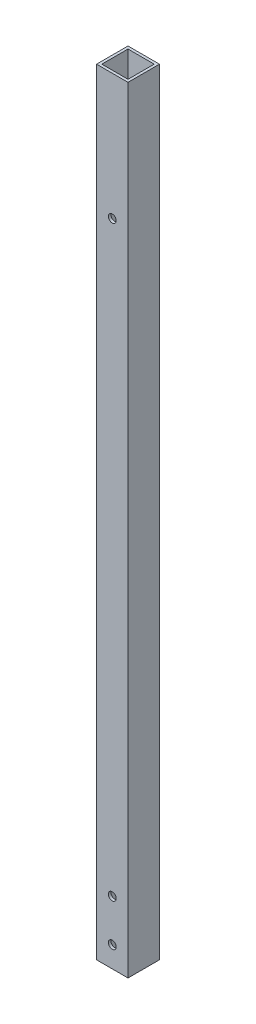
ISO-10303-21;
HEADER;
FILE_DESCRIPTION(('STEP AP214'),'2;1');
FILE_NAME('part.step','',(''),(''),'','','');
FILE_SCHEMA(('AUTOMOTIVE_DESIGN { 1 0 10303 214 1 1 1 1 }'));
ENDSEC;
DATA;
#1=APPLICATION_CONTEXT('core data for automotive mechanical design processes');
#2=APPLICATION_PROTOCOL_DEFINITION('international standard','automotive_design',2000,#1);
#3=PRODUCT_CONTEXT('',#1,'mechanical');
#4=PRODUCT('Part','Part','',(#3));
#5=PRODUCT_RELATED_PRODUCT_CATEGORY('part','',(#4));
#6=PRODUCT_DEFINITION_FORMATION('','',#4);
#7=PRODUCT_DEFINITION_CONTEXT('part definition',#1,'design');
#8=PRODUCT_DEFINITION('design','',#6,#7);
#9=PRODUCT_DEFINITION_SHAPE('','',#8);
#10=(LENGTH_UNIT() NAMED_UNIT(*) SI_UNIT(.MILLI.,.METRE.));
#11=(NAMED_UNIT(*) PLANE_ANGLE_UNIT() SI_UNIT($,.RADIAN.));
#12=(NAMED_UNIT(*) SI_UNIT($,.STERADIAN.) SOLID_ANGLE_UNIT());
#13=UNCERTAINTY_MEASURE_WITH_UNIT(LENGTH_MEASURE(1.E-05),#10,'distance_accuracy_value','');
#14=(GEOMETRIC_REPRESENTATION_CONTEXT(3) GLOBAL_UNCERTAINTY_ASSIGNED_CONTEXT((#13)) GLOBAL_UNIT_ASSIGNED_CONTEXT((#10,
#11,#12)) REPRESENTATION_CONTEXT('',''));
#15=CARTESIAN_POINT('',(0.,0.,0.));
#16=DIRECTION('',(0.,0.,1.));
#17=DIRECTION('',(1.,0.,0.));
#18=AXIS2_PLACEMENT_3D('',#15,#16,#17);
#19=CARTESIAN_POINT('',(0.,939.8,0.));
#20=DIRECTION('',(0.,1.,0.));
#21=DIRECTION('',(0.,0.,1.));
#22=AXIS2_PLACEMENT_3D('',#19,#20,#21);
#23=PLANE('',#22);
#24=DIRECTION('',(0.,0.,1.));
#25=VECTOR('',#24,1.);
#26=CARTESIAN_POINT('',(-19.05,939.8,-19.05));
#27=LINE('',#26,#25);
#28=CARTESIAN_POINT('',(-19.05,939.8,-19.05));
#29=VERTEX_POINT('',#28);
#30=CARTESIAN_POINT('',(-19.05,939.8,19.05));
#31=VERTEX_POINT('',#30);
#32=EDGE_CURVE('E143',#29,#31,#27,.T.);
#33=ORIENTED_EDGE('',*,*,#32,.T.);
#34=DIRECTION('',(1.,0.,0.));
#35=VECTOR('',#34,1.);
#36=CARTESIAN_POINT('',(-19.05,939.8,19.05));
#37=LINE('',#36,#35);
#38=CARTESIAN_POINT('',(19.05,939.8,19.05));
#39=VERTEX_POINT('',#38);
#40=EDGE_CURVE('E146',#31,#39,#37,.T.);
#41=ORIENTED_EDGE('',*,*,#40,.T.);
#42=DIRECTION('',(0.,0.,-1.));
#43=VECTOR('',#42,1.);
#44=CARTESIAN_POINT('',(19.05,939.8,-19.05));
#45=LINE('',#44,#43);
#46=CARTESIAN_POINT('',(19.05,939.8,-19.05));
#47=VERTEX_POINT('',#46);
#48=EDGE_CURVE('E149',#39,#47,#45,.T.);
#49=ORIENTED_EDGE('',*,*,#48,.T.);
#50=DIRECTION('',(-1.,0.,0.));
#51=VECTOR('',#50,1.);
#52=CARTESIAN_POINT('',(-19.05,939.8,-19.05));
#53=LINE('',#52,#51);
#54=EDGE_CURVE('E151',#47,#29,#53,.T.);
#55=ORIENTED_EDGE('',*,*,#54,.T.);
#56=EDGE_LOOP('',(#33,#41,#49,#55));
#57=FACE_BOUND('',#56,.T.);
#58=DIRECTION('',(1.,0.,0.));
#59=VECTOR('',#58,1.);
#60=CARTESIAN_POINT('',(-15.875,939.8,15.875));
#61=LINE('',#60,#59);
#62=CARTESIAN_POINT('',(-15.875,939.8,15.875));
#63=VERTEX_POINT('',#62);
#64=CARTESIAN_POINT('',(15.875,939.8,15.875));
#65=VERTEX_POINT('',#64);
#66=EDGE_CURVE('E113',#63,#65,#61,.T.);
#67=ORIENTED_EDGE('',*,*,#66,.F.);
#68=DIRECTION('',(0.,0.,1.));
#69=VECTOR('',#68,1.);
#70=CARTESIAN_POINT('',(-15.875,939.8,-15.875));
#71=LINE('',#70,#69);
#72=CARTESIAN_POINT('',(-15.875,939.8,-15.875));
#73=VERTEX_POINT('',#72);
#74=EDGE_CURVE('E105',#73,#63,#71,.T.);
#75=ORIENTED_EDGE('',*,*,#74,.F.);
#76=DIRECTION('',(-1.,0.,0.));
#77=VECTOR('',#76,1.);
#78=CARTESIAN_POINT('',(-15.875,939.8,-15.875));
#79=LINE('',#78,#77);
#80=CARTESIAN_POINT('',(15.875,939.8,-15.875));
#81=VERTEX_POINT('',#80);
#82=EDGE_CURVE('E127',#81,#73,#79,.T.);
#83=ORIENTED_EDGE('',*,*,#82,.F.);
#84=DIRECTION('',(0.,0.,-1.));
#85=VECTOR('',#84,1.);
#86=CARTESIAN_POINT('',(15.875,939.8,-15.875));
#87=LINE('',#86,#85);
#88=EDGE_CURVE('E125',#65,#81,#87,.T.);
#89=ORIENTED_EDGE('',*,*,#88,.F.);
#90=EDGE_LOOP('',(#67,#75,#83,#89));
#91=FACE_BOUND('',#90,.T.);
#92=ADVANCED_FACE('F38',(#57,#91),#23,.T.);
#93=CARTESIAN_POINT('',(0.,0.,0.));
#94=DIRECTION('',(0.,1.,0.));
#95=DIRECTION('',(0.,0.,1.));
#96=AXIS2_PLACEMENT_3D('',#93,#94,#95);
#97=PLANE('',#96);
#98=DIRECTION('',(0.,0.,1.));
#99=VECTOR('',#98,1.);
#100=CARTESIAN_POINT('',(-19.05,0.,-19.05));
#101=LINE('',#100,#99);
#102=CARTESIAN_POINT('',(-19.05,0.,-19.05));
#103=VERTEX_POINT('',#102);
#104=CARTESIAN_POINT('',(-19.05,0.,19.05));
#105=VERTEX_POINT('',#104);
#106=EDGE_CURVE('E121',#103,#105,#101,.T.);
#107=ORIENTED_EDGE('',*,*,#106,.F.);
#108=DIRECTION('',(-1.,0.,0.));
#109=VECTOR('',#108,1.);
#110=CARTESIAN_POINT('',(-19.05,0.,-19.05));
#111=LINE('',#110,#109);
#112=CARTESIAN_POINT('',(19.05,0.,-19.05));
#113=VERTEX_POINT('',#112);
#114=EDGE_CURVE('E147',#113,#103,#111,.T.);
#115=ORIENTED_EDGE('',*,*,#114,.F.);
#116=DIRECTION('',(0.,0.,-1.));
#117=VECTOR('',#116,1.);
#118=CARTESIAN_POINT('',(19.05,0.,-19.05));
#119=LINE('',#118,#117);
#120=CARTESIAN_POINT('',(19.05,0.,19.05));
#121=VERTEX_POINT('',#120);
#122=EDGE_CURVE('E158',#121,#113,#119,.T.);
#123=ORIENTED_EDGE('',*,*,#122,.F.);
#124=DIRECTION('',(1.,0.,0.));
#125=VECTOR('',#124,1.);
#126=CARTESIAN_POINT('',(-19.05,0.,19.05));
#127=LINE('',#126,#125);
#128=EDGE_CURVE('E156',#105,#121,#127,.T.);
#129=ORIENTED_EDGE('',*,*,#128,.F.);
#130=EDGE_LOOP('',(#107,#115,#123,#129));
#131=FACE_BOUND('',#130,.T.);
#132=DIRECTION('',(0.,0.,1.));
#133=VECTOR('',#132,1.);
#134=CARTESIAN_POINT('',(-15.875,0.,-15.875));
#135=LINE('',#134,#133);
#136=CARTESIAN_POINT('',(-15.875,0.,-15.875));
#137=VERTEX_POINT('',#136);
#138=CARTESIAN_POINT('',(-15.875,0.,15.875));
#139=VERTEX_POINT('',#138);
#140=EDGE_CURVE('E63',#137,#139,#135,.T.);
#141=ORIENTED_EDGE('',*,*,#140,.T.);
#142=DIRECTION('',(1.,0.,0.));
#143=VECTOR('',#142,1.);
#144=CARTESIAN_POINT('',(-15.875,0.,15.875));
#145=LINE('',#144,#143);
#146=CARTESIAN_POINT('',(15.875,0.,15.875));
#147=VERTEX_POINT('',#146);
#148=EDGE_CURVE('E120',#139,#147,#145,.T.);
#149=ORIENTED_EDGE('',*,*,#148,.T.);
#150=DIRECTION('',(0.,0.,-1.));
#151=VECTOR('',#150,1.);
#152=CARTESIAN_POINT('',(15.875,0.,-15.875));
#153=LINE('',#152,#151);
#154=CARTESIAN_POINT('',(15.875,0.,-15.875));
#155=VERTEX_POINT('',#154);
#156=EDGE_CURVE('E135',#147,#155,#153,.T.);
#157=ORIENTED_EDGE('',*,*,#156,.T.);
#158=DIRECTION('',(-1.,0.,0.));
#159=VECTOR('',#158,1.);
#160=CARTESIAN_POINT('',(-15.875,0.,-15.875));
#161=LINE('',#160,#159);
#162=EDGE_CURVE('E114',#155,#137,#161,.T.);
#163=ORIENTED_EDGE('',*,*,#162,.T.);
#164=EDGE_LOOP('',(#141,#149,#157,#163));
#165=FACE_BOUND('',#164,.T.);
#166=ADVANCED_FACE('F216',(#131,#165),#97,.F.);
#167=CARTESIAN_POINT('',(-19.05,939.8,-19.05));
#168=DIRECTION('',(1.,0.,0.));
#169=DIRECTION('',(0.,0.,-1.));
#170=AXIS2_PLACEMENT_3D('',#167,#168,#169);
#171=PLANE('',#170);
#172=ORIENTED_EDGE('',*,*,#106,.T.);
#173=DIRECTION('',(0.,-1.,0.));
#174=VECTOR('',#173,1.);
#175=CARTESIAN_POINT('',(-19.05,939.8,19.05));
#176=LINE('',#175,#174);
#177=EDGE_CURVE('E11',#31,#105,#176,.T.);
#178=ORIENTED_EDGE('',*,*,#177,.F.);
#179=ORIENTED_EDGE('',*,*,#32,.F.);
#180=DIRECTION('',(0.,-1.,0.));
#181=VECTOR('',#180,1.);
#182=CARTESIAN_POINT('',(-19.05,939.8,-19.05));
#183=LINE('',#182,#181);
#184=EDGE_CURVE('E153',#29,#103,#183,.T.);
#185=ORIENTED_EDGE('',*,*,#184,.T.);
#186=EDGE_LOOP('',(#172,#178,#179,#185));
#187=FACE_BOUND('',#186,.T.);
#188=ADVANCED_FACE('F40',(#187),#171,.F.);
#189=CARTESIAN_POINT('',(-19.05,939.8,19.05));
#190=DIRECTION('',(0.,0.,-1.));
#191=DIRECTION('',(-1.,0.,0.));
#192=AXIS2_PLACEMENT_3D('',#189,#190,#191);
#193=PLANE('',#192);
#194=CARTESIAN_POINT('',(0.,787.4,19.05));
#195=DIRECTION('',(0.,0.,-1.));
#196=DIRECTION('',(-1.,0.,0.));
#197=AXIS2_PLACEMENT_3D('',#194,#195,#196);
#198=CIRCLE('',#197,4.76250000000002);
#199=CARTESIAN_POINT('',(-4.76250000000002,787.4,19.05));
#200=VERTEX_POINT('',#199);
#201=EDGE_CURVE('E240',#200,#200,#198,.T.);
#202=ORIENTED_EDGE('',*,*,#201,.T.);
#203=EDGE_LOOP('',(#202));
#204=FACE_BOUND('',#203,.T.);
#205=CARTESIAN_POINT('',(0.,76.2,19.05));
#206=DIRECTION('',(0.,0.,-1.));
#207=DIRECTION('',(-1.,0.,0.));
#208=AXIS2_PLACEMENT_3D('',#205,#206,#207);
#209=CIRCLE('',#208,4.7625);
#210=CARTESIAN_POINT('',(-4.7625,76.2,19.05));
#211=VERTEX_POINT('',#210);
#212=EDGE_CURVE('E174',#211,#211,#209,.T.);
#213=ORIENTED_EDGE('',*,*,#212,.T.);
#214=EDGE_LOOP('',(#213));
#215=FACE_BOUND('',#214,.T.);
#216=CARTESIAN_POINT('',(0.,25.4,19.05));
#217=DIRECTION('',(0.,0.,-1.));
#218=DIRECTION('',(-1.,0.,0.));
#219=AXIS2_PLACEMENT_3D('',#216,#217,#218);
#220=CIRCLE('',#219,4.7625);
#221=CARTESIAN_POINT('',(-4.7625,25.4,19.05));
#222=VERTEX_POINT('',#221);
#223=EDGE_CURVE('E170',#222,#222,#220,.T.);
#224=ORIENTED_EDGE('',*,*,#223,.T.);
#225=EDGE_LOOP('',(#224));
#226=FACE_BOUND('',#225,.T.);
#227=ORIENTED_EDGE('',*,*,#128,.T.);
#228=DIRECTION('',(0.,-1.,0.));
#229=VECTOR('',#228,1.);
#230=CARTESIAN_POINT('',(19.05,939.8,19.05));
#231=LINE('',#230,#229);
#232=EDGE_CURVE('E47',#39,#121,#231,.T.);
#233=ORIENTED_EDGE('',*,*,#232,.F.);
#234=ORIENTED_EDGE('',*,*,#40,.F.);
#235=ORIENTED_EDGE('',*,*,#177,.T.);
#236=EDGE_LOOP('',(#227,#233,#234,#235));
#237=FACE_BOUND('',#236,.T.);
#238=ADVANCED_FACE('F230',(#204,#215,#226,#237),#193,.F.);
#239=CARTESIAN_POINT('',(19.05,939.8,-19.05));
#240=DIRECTION('',(-1.,0.,0.));
#241=DIRECTION('',(0.,0.,1.));
#242=AXIS2_PLACEMENT_3D('',#239,#240,#241);
#243=PLANE('',#242);
#244=ORIENTED_EDGE('',*,*,#122,.T.);
#245=DIRECTION('',(0.,-1.,0.));
#246=VECTOR('',#245,1.);
#247=CARTESIAN_POINT('',(19.05,939.8,-19.05));
#248=LINE('',#247,#246);
#249=EDGE_CURVE('E163',#47,#113,#248,.T.);
#250=ORIENTED_EDGE('',*,*,#249,.F.);
#251=ORIENTED_EDGE('',*,*,#48,.F.);
#252=ORIENTED_EDGE('',*,*,#232,.T.);
#253=EDGE_LOOP('',(#244,#250,#251,#252));
#254=FACE_BOUND('',#253,.T.);
#255=ADVANCED_FACE('F227',(#254),#243,.F.);
#256=CARTESIAN_POINT('',(-19.05,939.8,-19.05));
#257=DIRECTION('',(0.,0.,1.));
#258=DIRECTION('',(1.,0.,0.));
#259=AXIS2_PLACEMENT_3D('',#256,#257,#258);
#260=PLANE('',#259);
#261=CARTESIAN_POINT('',(0.,787.4,-19.05));
#262=DIRECTION('',(0.,0.,-1.));
#263=DIRECTION('',(-1.,0.,0.));
#264=AXIS2_PLACEMENT_3D('',#261,#262,#263);
#265=CIRCLE('',#264,4.76250000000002);
#266=CARTESIAN_POINT('',(-4.76250000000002,787.4,-19.05));
#267=VERTEX_POINT('',#266);
#268=EDGE_CURVE('E287',#267,#267,#265,.T.);
#269=ORIENTED_EDGE('',*,*,#268,.F.);
#270=EDGE_LOOP('',(#269));
#271=FACE_BOUND('',#270,.T.);
#272=CARTESIAN_POINT('',(0.,76.2,-19.05));
#273=DIRECTION('',(0.,0.,-1.));
#274=DIRECTION('',(-1.,0.,0.));
#275=AXIS2_PLACEMENT_3D('',#272,#273,#274);
#276=CIRCLE('',#275,4.7625);
#277=CARTESIAN_POINT('',(-4.7625,76.2,-19.05));
#278=VERTEX_POINT('',#277);
#279=EDGE_CURVE('E181',#278,#278,#276,.T.);
#280=ORIENTED_EDGE('',*,*,#279,.F.);
#281=EDGE_LOOP('',(#280));
#282=FACE_BOUND('',#281,.T.);
#283=CARTESIAN_POINT('',(0.,25.4,-19.05));
#284=DIRECTION('',(0.,0.,-1.));
#285=DIRECTION('',(-1.,0.,0.));
#286=AXIS2_PLACEMENT_3D('',#283,#284,#285);
#287=CIRCLE('',#286,4.7625);
#288=CARTESIAN_POINT('',(-4.7625,25.4,-19.05));
#289=VERTEX_POINT('',#288);
#290=EDGE_CURVE('E178',#289,#289,#287,.T.);
#291=ORIENTED_EDGE('',*,*,#290,.F.);
#292=EDGE_LOOP('',(#291));
#293=FACE_BOUND('',#292,.T.);
#294=ORIENTED_EDGE('',*,*,#114,.T.);
#295=ORIENTED_EDGE('',*,*,#184,.F.);
#296=ORIENTED_EDGE('',*,*,#54,.F.);
#297=ORIENTED_EDGE('',*,*,#249,.T.);
#298=EDGE_LOOP('',(#294,#295,#296,#297));
#299=FACE_BOUND('',#298,.T.);
#300=ADVANCED_FACE('F211',(#271,#282,#293,#299),#260,.F.);
#301=CARTESIAN_POINT('',(-15.875,939.8,-15.875));
#302=DIRECTION('',(1.,0.,0.));
#303=DIRECTION('',(0.,0.,-1.));
#304=AXIS2_PLACEMENT_3D('',#301,#302,#303);
#305=PLANE('',#304);
#306=ORIENTED_EDGE('',*,*,#140,.F.);
#307=DIRECTION('',(0.,-1.,0.));
#308=VECTOR('',#307,1.);
#309=CARTESIAN_POINT('',(-15.875,939.8,-15.875));
#310=LINE('',#309,#308);
#311=EDGE_CURVE('E109',#73,#137,#310,.T.);
#312=ORIENTED_EDGE('',*,*,#311,.F.);
#313=ORIENTED_EDGE('',*,*,#74,.T.);
#314=DIRECTION('',(0.,-1.,0.));
#315=VECTOR('',#314,1.);
#316=CARTESIAN_POINT('',(-15.875,939.8,15.875));
#317=LINE('',#316,#315);
#318=EDGE_CURVE('E108',#63,#139,#317,.T.);
#319=ORIENTED_EDGE('',*,*,#318,.T.);
#320=EDGE_LOOP('',(#306,#312,#313,#319));
#321=FACE_BOUND('',#320,.T.);
#322=ADVANCED_FACE('F107',(#321),#305,.T.);
#323=CARTESIAN_POINT('',(-15.875,939.8,15.875));
#324=DIRECTION('',(0.,0.,-1.));
#325=DIRECTION('',(-1.,0.,0.));
#326=AXIS2_PLACEMENT_3D('',#323,#324,#325);
#327=PLANE('',#326);
#328=CARTESIAN_POINT('',(0.,787.4,15.875));
#329=DIRECTION('',(0.,0.,-1.));
#330=DIRECTION('',(-1.,0.,0.));
#331=AXIS2_PLACEMENT_3D('',#328,#329,#330);
#332=CIRCLE('',#331,4.76250000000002);
#333=CARTESIAN_POINT('',(-4.76250000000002,787.4,15.875));
#334=VERTEX_POINT('',#333);
#335=EDGE_CURVE('E186',#334,#334,#332,.T.);
#336=ORIENTED_EDGE('',*,*,#335,.F.);
#337=EDGE_LOOP('',(#336));
#338=FACE_BOUND('',#337,.T.);
#339=CARTESIAN_POINT('',(0.,76.2,15.875));
#340=DIRECTION('',(0.,0.,-1.));
#341=DIRECTION('',(-1.,0.,0.));
#342=AXIS2_PLACEMENT_3D('',#339,#340,#341);
#343=CIRCLE('',#342,4.7625);
#344=CARTESIAN_POINT('',(-4.7625,76.2,15.875));
#345=VERTEX_POINT('',#344);
#346=EDGE_CURVE('E173',#345,#345,#343,.T.);
#347=ORIENTED_EDGE('',*,*,#346,.F.);
#348=EDGE_LOOP('',(#347));
#349=FACE_BOUND('',#348,.T.);
#350=CARTESIAN_POINT('',(0.,25.4,15.875));
#351=DIRECTION('',(0.,0.,-1.));
#352=DIRECTION('',(-1.,0.,0.));
#353=AXIS2_PLACEMENT_3D('',#350,#351,#352);
#354=CIRCLE('',#353,4.7625);
#355=CARTESIAN_POINT('',(-4.7625,25.4,15.875));
#356=VERTEX_POINT('',#355);
#357=EDGE_CURVE('E133',#356,#356,#354,.T.);
#358=ORIENTED_EDGE('',*,*,#357,.F.);
#359=EDGE_LOOP('',(#358));
#360=FACE_BOUND('',#359,.T.);
#361=ORIENTED_EDGE('',*,*,#148,.F.);
#362=ORIENTED_EDGE('',*,*,#318,.F.);
#363=ORIENTED_EDGE('',*,*,#66,.T.);
#364=DIRECTION('',(0.,-1.,0.));
#365=VECTOR('',#364,1.);
#366=CARTESIAN_POINT('',(15.875,939.8,15.875));
#367=LINE('',#366,#365);
#368=EDGE_CURVE('E122',#65,#147,#367,.T.);
#369=ORIENTED_EDGE('',*,*,#368,.T.);
#370=EDGE_LOOP('',(#361,#362,#363,#369));
#371=FACE_BOUND('',#370,.T.);
#372=ADVANCED_FACE('F117',(#338,#349,#360,#371),#327,.T.);
#373=CARTESIAN_POINT('',(15.875,939.8,-15.875));
#374=DIRECTION('',(-1.,0.,0.));
#375=DIRECTION('',(0.,0.,1.));
#376=AXIS2_PLACEMENT_3D('',#373,#374,#375);
#377=PLANE('',#376);
#378=ORIENTED_EDGE('',*,*,#156,.F.);
#379=ORIENTED_EDGE('',*,*,#368,.F.);
#380=ORIENTED_EDGE('',*,*,#88,.T.);
#381=DIRECTION('',(0.,-1.,0.));
#382=VECTOR('',#381,1.);
#383=CARTESIAN_POINT('',(15.875,939.8,-15.875));
#384=LINE('',#383,#382);
#385=EDGE_CURVE('E55',#81,#155,#384,.T.);
#386=ORIENTED_EDGE('',*,*,#385,.T.);
#387=EDGE_LOOP('',(#378,#379,#380,#386));
#388=FACE_BOUND('',#387,.T.);
#389=ADVANCED_FACE('F201',(#388),#377,.T.);
#390=CARTESIAN_POINT('',(-15.875,939.8,-15.875));
#391=DIRECTION('',(0.,0.,1.));
#392=DIRECTION('',(1.,0.,0.));
#393=AXIS2_PLACEMENT_3D('',#390,#391,#392);
#394=PLANE('',#393);
#395=CARTESIAN_POINT('',(0.,787.4,-15.875));
#396=DIRECTION('',(0.,0.,1.));
#397=DIRECTION('',(1.,0.,0.));
#398=AXIS2_PLACEMENT_3D('',#395,#396,#397);
#399=CIRCLE('',#398,4.76250000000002);
#400=CARTESIAN_POINT('',(-4.76250000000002,787.4,-15.875));
#401=VERTEX_POINT('',#400);
#402=EDGE_CURVE('E42',#401,#401,#399,.T.);
#403=ORIENTED_EDGE('',*,*,#402,.F.);
#404=EDGE_LOOP('',(#403));
#405=FACE_BOUND('',#404,.T.);
#406=CARTESIAN_POINT('',(0.,76.2,-15.875));
#407=DIRECTION('',(0.,0.,1.));
#408=DIRECTION('',(1.,0.,0.));
#409=AXIS2_PLACEMENT_3D('',#406,#407,#408);
#410=CIRCLE('',#409,4.7625);
#411=CARTESIAN_POINT('',(-4.7625,76.2,-15.875));
#412=VERTEX_POINT('',#411);
#413=EDGE_CURVE('E171',#412,#412,#410,.T.);
#414=ORIENTED_EDGE('',*,*,#413,.F.);
#415=EDGE_LOOP('',(#414));
#416=FACE_BOUND('',#415,.T.);
#417=CARTESIAN_POINT('',(0.,25.4,-15.875));
#418=DIRECTION('',(0.,0.,1.));
#419=DIRECTION('',(1.,0.,0.));
#420=AXIS2_PLACEMENT_3D('',#417,#418,#419);
#421=CIRCLE('',#420,4.7625);
#422=CARTESIAN_POINT('',(-4.7625,25.4,-15.875));
#423=VERTEX_POINT('',#422);
#424=EDGE_CURVE('E168',#423,#423,#421,.T.);
#425=ORIENTED_EDGE('',*,*,#424,.F.);
#426=EDGE_LOOP('',(#425));
#427=FACE_BOUND('',#426,.T.);
#428=ORIENTED_EDGE('',*,*,#162,.F.);
#429=ORIENTED_EDGE('',*,*,#385,.F.);
#430=ORIENTED_EDGE('',*,*,#82,.T.);
#431=ORIENTED_EDGE('',*,*,#311,.T.);
#432=EDGE_LOOP('',(#428,#429,#430,#431));
#433=FACE_BOUND('',#432,.T.);
#434=ADVANCED_FACE('F208',(#405,#416,#427,#433),#394,.T.);
#435=CARTESIAN_POINT('',(0.,25.4,19.05));
#436=DIRECTION('',(0.,0.,-1.));
#437=DIRECTION('',(-1.,0.,0.));
#438=AXIS2_PLACEMENT_3D('',#435,#436,#437);
#439=CYLINDRICAL_SURFACE('',#438,4.7625);
#440=CARTESIAN_POINT('',(-4.7625,25.4,-15.875));
#441=CARTESIAN_POINT('',(-4.7625,25.4,-15.9080729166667));
#442=CARTESIAN_POINT('',(-4.7625,25.4,-15.9411458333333));
#443=CARTESIAN_POINT('',(-4.7625,25.4,-16.0072916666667));
#444=CARTESIAN_POINT('',(-4.7625,25.4,-16.0403645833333));
#445=CARTESIAN_POINT('',(-4.7625,25.4,-16.1065104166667));
#446=CARTESIAN_POINT('',(-4.7625,25.4,-16.1395833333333));
#447=CARTESIAN_POINT('',(-4.7625,25.4,-16.2057291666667));
#448=CARTESIAN_POINT('',(-4.7625,25.4,-16.2388020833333));
#449=CARTESIAN_POINT('',(-4.7625,25.4,-16.3049479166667));
#450=CARTESIAN_POINT('',(-4.7625,25.4,-16.3380208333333));
#451=CARTESIAN_POINT('',(-4.7625,25.4,-16.4041666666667));
#452=CARTESIAN_POINT('',(-4.7625,25.4,-16.4372395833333));
#453=CARTESIAN_POINT('',(-4.7625,25.4,-16.5033854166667));
#454=CARTESIAN_POINT('',(-4.7625,25.4,-16.5364583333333));
#455=CARTESIAN_POINT('',(-4.7625,25.4,-16.6026041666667));
#456=CARTESIAN_POINT('',(-4.7625,25.4,-16.6356770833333));
#457=CARTESIAN_POINT('',(-4.7625,25.4,-16.7018229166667));
#458=CARTESIAN_POINT('',(-4.7625,25.4,-16.7348958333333));
#459=CARTESIAN_POINT('',(-4.7625,25.4,-16.8010416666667));
#460=CARTESIAN_POINT('',(-4.7625,25.4,-16.8341145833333));
#461=CARTESIAN_POINT('',(-4.7625,25.4,-16.9002604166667));
#462=CARTESIAN_POINT('',(-4.7625,25.4,-16.9333333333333));
#463=CARTESIAN_POINT('',(-4.7625,25.4,-16.9994791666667));
#464=CARTESIAN_POINT('',(-4.7625,25.4,-17.0325520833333));
#465=CARTESIAN_POINT('',(-4.7625,25.4,-17.0986979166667));
#466=CARTESIAN_POINT('',(-4.7625,25.4,-17.1317708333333));
#467=CARTESIAN_POINT('',(-4.7625,25.4,-17.1979166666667));
#468=CARTESIAN_POINT('',(-4.7625,25.4,-17.2309895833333));
#469=CARTESIAN_POINT('',(-4.7625,25.4,-17.2971354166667));
#470=CARTESIAN_POINT('',(-4.7625,25.4,-17.3302083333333));
#471=CARTESIAN_POINT('',(-4.7625,25.4,-17.3963541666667));
#472=CARTESIAN_POINT('',(-4.7625,25.4,-17.4294270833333));
#473=CARTESIAN_POINT('',(-4.7625,25.4,-17.4955729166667));
#474=CARTESIAN_POINT('',(-4.7625,25.4,-17.5286458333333));
#475=CARTESIAN_POINT('',(-4.7625,25.4,-17.5947916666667));
#476=CARTESIAN_POINT('',(-4.7625,25.4,-17.6278645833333));
#477=CARTESIAN_POINT('',(-4.7625,25.4,-17.6940104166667));
#478=CARTESIAN_POINT('',(-4.7625,25.4,-17.7270833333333));
#479=CARTESIAN_POINT('',(-4.7625,25.4,-17.7932291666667));
#480=CARTESIAN_POINT('',(-4.7625,25.4,-17.8263020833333));
#481=CARTESIAN_POINT('',(-4.7625,25.4,-17.8924479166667));
#482=CARTESIAN_POINT('',(-4.7625,25.4,-17.9255208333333));
#483=CARTESIAN_POINT('',(-4.7625,25.4,-17.9916666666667));
#484=CARTESIAN_POINT('',(-4.7625,25.4,-18.0247395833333));
#485=CARTESIAN_POINT('',(-4.7625,25.4,-18.0908854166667));
#486=CARTESIAN_POINT('',(-4.7625,25.4,-18.1239583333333));
#487=CARTESIAN_POINT('',(-4.7625,25.4,-18.1901041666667));
#488=CARTESIAN_POINT('',(-4.7625,25.4,-18.2231770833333));
#489=CARTESIAN_POINT('',(-4.7625,25.4,-18.2893229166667));
#490=CARTESIAN_POINT('',(-4.7625,25.4,-18.3223958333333));
#491=CARTESIAN_POINT('',(-4.7625,25.4,-18.3885416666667));
#492=CARTESIAN_POINT('',(-4.7625,25.4,-18.4216145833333));
#493=CARTESIAN_POINT('',(-4.7625,25.4,-18.4877604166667));
#494=CARTESIAN_POINT('',(-4.7625,25.4,-18.5208333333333));
#495=CARTESIAN_POINT('',(-4.7625,25.4,-18.5869791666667));
#496=CARTESIAN_POINT('',(-4.7625,25.4,-18.6200520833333));
#497=CARTESIAN_POINT('',(-4.7625,25.4,-18.6861979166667));
#498=CARTESIAN_POINT('',(-4.7625,25.4,-18.7192708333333));
#499=CARTESIAN_POINT('',(-4.7625,25.4,-18.7854166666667));
#500=CARTESIAN_POINT('',(-4.7625,25.4,-18.8184895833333));
#501=CARTESIAN_POINT('',(-4.7625,25.4,-18.8846354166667));
#502=CARTESIAN_POINT('',(-4.7625,25.4,-18.9177083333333));
#503=CARTESIAN_POINT('',(-4.7625,25.4,-18.9838541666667));
#504=CARTESIAN_POINT('',(-4.7625,25.4,-19.0169270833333));
#505=CARTESIAN_POINT('',(-4.7625,25.4,-19.05));
#506=B_SPLINE_CURVE_WITH_KNOTS('',3,(#440,#441,#442,#443,#444,#445,#446,#447,#448,#449,#450,
#451,#452,#453,#454,#455,#456,#457,#458,#459,#460,#461,#462,#463,#464,#465,#466,#467,#468,#469,
#470,#471,#472,#473,#474,#475,#476,#477,#478,#479,#480,#481,#482,#483,#484,#485,#486,#487,#488,
#489,#490,#491,#492,#493,#494,#495,#496,#497,#498,#499,#500,#501,#502,#503,#504,#505),
.UNSPECIFIED.,.F.,.F.,(4,2,2,2,2,2,2,2,2,2,2,2,2,2,2,2,2,2,2,2,2,2,2,2,2,2,2,2,2,2,2,2,4),(0.,
0.0992187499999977,0.198437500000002,0.29765625,0.396874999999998,0.496093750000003,0.5953125,
0.694531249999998,0.793749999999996,0.892968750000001,0.992187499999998,1.09140625,1.190625,
1.28984375,1.3890625,1.48828125,1.5875,1.68671875,1.7859375,1.88515625,1.984375,2.08359375,
2.1828125,2.28203125,2.38125,2.48046875,2.5796875,2.67890624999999,2.778125,2.87734375,
2.97656249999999,3.07578125,3.175),.UNSPECIFIED.);
#507=EDGE_CURVE('BSEAM258',#423,#289,#506,.T.);
#508=ORIENTED_EDGE('',*,*,#424,.T.);
#509=ORIENTED_EDGE('',*,*,#290,.T.);
#510=ORIENTED_EDGE('',*,*,#507,.T.);
#511=ORIENTED_EDGE('',*,*,#507,.F.);
#512=EDGE_LOOP('',(#508,#510,#509,#511));
#513=FACE_BOUND('',#512,.T.);
#514=ADVANCED_FACE('F258',(#513),#439,.F.);
#515=CARTESIAN_POINT('',(-4.7625,25.4,15.875));
#516=CARTESIAN_POINT('',(-4.7625,25.4,15.9080729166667));
#517=CARTESIAN_POINT('',(-4.7625,25.4,15.9411458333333));
#518=CARTESIAN_POINT('',(-4.7625,25.4,16.0072916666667));
#519=CARTESIAN_POINT('',(-4.7625,25.4,16.0403645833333));
#520=CARTESIAN_POINT('',(-4.7625,25.4,16.1065104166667));
#521=CARTESIAN_POINT('',(-4.7625,25.4,16.1395833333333));
#522=CARTESIAN_POINT('',(-4.7625,25.4,16.2057291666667));
#523=CARTESIAN_POINT('',(-4.7625,25.4,16.2388020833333));
#524=CARTESIAN_POINT('',(-4.7625,25.4,16.3049479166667));
#525=CARTESIAN_POINT('',(-4.7625,25.4,16.3380208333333));
#526=CARTESIAN_POINT('',(-4.7625,25.4,16.4041666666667));
#527=CARTESIAN_POINT('',(-4.7625,25.4,16.4372395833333));
#528=CARTESIAN_POINT('',(-4.7625,25.4,16.5033854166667));
#529=CARTESIAN_POINT('',(-4.7625,25.4,16.5364583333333));
#530=CARTESIAN_POINT('',(-4.7625,25.4,16.6026041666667));
#531=CARTESIAN_POINT('',(-4.7625,25.4,16.6356770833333));
#532=CARTESIAN_POINT('',(-4.7625,25.4,16.7018229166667));
#533=CARTESIAN_POINT('',(-4.7625,25.4,16.7348958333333));
#534=CARTESIAN_POINT('',(-4.7625,25.4,16.8010416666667));
#535=CARTESIAN_POINT('',(-4.7625,25.4,16.8341145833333));
#536=CARTESIAN_POINT('',(-4.7625,25.4,16.9002604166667));
#537=CARTESIAN_POINT('',(-4.7625,25.4,16.9333333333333));
#538=CARTESIAN_POINT('',(-4.7625,25.4,16.9994791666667));
#539=CARTESIAN_POINT('',(-4.7625,25.4,17.0325520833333));
#540=CARTESIAN_POINT('',(-4.7625,25.4,17.0986979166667));
#541=CARTESIAN_POINT('',(-4.7625,25.4,17.1317708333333));
#542=CARTESIAN_POINT('',(-4.7625,25.4,17.1979166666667));
#543=CARTESIAN_POINT('',(-4.7625,25.4,17.2309895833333));
#544=CARTESIAN_POINT('',(-4.7625,25.4,17.2971354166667));
#545=CARTESIAN_POINT('',(-4.7625,25.4,17.3302083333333));
#546=CARTESIAN_POINT('',(-4.7625,25.4,17.3963541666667));
#547=CARTESIAN_POINT('',(-4.7625,25.4,17.4294270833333));
#548=CARTESIAN_POINT('',(-4.7625,25.4,17.4955729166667));
#549=CARTESIAN_POINT('',(-4.7625,25.4,17.5286458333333));
#550=CARTESIAN_POINT('',(-4.7625,25.4,17.5947916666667));
#551=CARTESIAN_POINT('',(-4.7625,25.4,17.6278645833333));
#552=CARTESIAN_POINT('',(-4.7625,25.4,17.6940104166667));
#553=CARTESIAN_POINT('',(-4.7625,25.4,17.7270833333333));
#554=CARTESIAN_POINT('',(-4.7625,25.4,17.7932291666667));
#555=CARTESIAN_POINT('',(-4.7625,25.4,17.8263020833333));
#556=CARTESIAN_POINT('',(-4.7625,25.4,17.8924479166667));
#557=CARTESIAN_POINT('',(-4.7625,25.4,17.9255208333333));
#558=CARTESIAN_POINT('',(-4.7625,25.4,17.9916666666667));
#559=CARTESIAN_POINT('',(-4.7625,25.4,18.0247395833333));
#560=CARTESIAN_POINT('',(-4.7625,25.4,18.0908854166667));
#561=CARTESIAN_POINT('',(-4.7625,25.4,18.1239583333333));
#562=CARTESIAN_POINT('',(-4.7625,25.4,18.1901041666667));
#563=CARTESIAN_POINT('',(-4.7625,25.4,18.2231770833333));
#564=CARTESIAN_POINT('',(-4.7625,25.4,18.2893229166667));
#565=CARTESIAN_POINT('',(-4.7625,25.4,18.3223958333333));
#566=CARTESIAN_POINT('',(-4.7625,25.4,18.3885416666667));
#567=CARTESIAN_POINT('',(-4.7625,25.4,18.4216145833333));
#568=CARTESIAN_POINT('',(-4.7625,25.4,18.4877604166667));
#569=CARTESIAN_POINT('',(-4.7625,25.4,18.5208333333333));
#570=CARTESIAN_POINT('',(-4.7625,25.4,18.5869791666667));
#571=CARTESIAN_POINT('',(-4.7625,25.4,18.6200520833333));
#572=CARTESIAN_POINT('',(-4.7625,25.4,18.6861979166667));
#573=CARTESIAN_POINT('',(-4.7625,25.4,18.7192708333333));
#574=CARTESIAN_POINT('',(-4.7625,25.4,18.7854166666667));
#575=CARTESIAN_POINT('',(-4.7625,25.4,18.8184895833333));
#576=CARTESIAN_POINT('',(-4.7625,25.4,18.8846354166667));
#577=CARTESIAN_POINT('',(-4.7625,25.4,18.9177083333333));
#578=CARTESIAN_POINT('',(-4.7625,25.4,18.9838541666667));
#579=CARTESIAN_POINT('',(-4.7625,25.4,19.0169270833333));
#580=CARTESIAN_POINT('',(-4.7625,25.4,19.05));
#581=B_SPLINE_CURVE_WITH_KNOTS('',3,(#515,#516,#517,#518,#519,#520,#521,#522,#523,#524,#525,
#526,#527,#528,#529,#530,#531,#532,#533,#534,#535,#536,#537,#538,#539,#540,#541,#542,#543,#544,
#545,#546,#547,#548,#549,#550,#551,#552,#553,#554,#555,#556,#557,#558,#559,#560,#561,#562,#563,
#564,#565,#566,#567,#568,#569,#570,#571,#572,#573,#574,#575,#576,#577,#578,#579,#580),
.UNSPECIFIED.,.F.,.F.,(4,2,2,2,2,2,2,2,2,2,2,2,2,2,2,2,2,2,2,2,2,2,2,2,2,2,2,2,2,2,2,2,4),(0.,
0.0992187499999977,0.198437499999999,0.29765625,0.396874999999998,0.496093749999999,0.5953125,
0.694531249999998,0.793749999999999,0.892968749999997,0.992187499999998,1.09140625,1.190625,
1.28984375,1.3890625,1.48828125,1.5875,1.68671875,1.7859375,1.88515625,1.984375,2.08359375,
2.1828125,2.28203125,2.38125,2.48046875,2.5796875,2.67890625,2.778125,2.87734375,2.9765625,
3.07578125,3.175),.UNSPECIFIED.);
#582=EDGE_CURVE('BSEAM197',#356,#222,#581,.T.);
#583=ORIENTED_EDGE('',*,*,#357,.T.);
#584=ORIENTED_EDGE('',*,*,#223,.F.);
#585=ORIENTED_EDGE('',*,*,#582,.T.);
#586=ORIENTED_EDGE('',*,*,#582,.F.);
#587=EDGE_LOOP('',(#583,#585,#584,#586));
#588=FACE_BOUND('',#587,.T.);
#589=ADVANCED_FACE('F197',(#588),#439,.F.);
#590=CARTESIAN_POINT('',(0.,76.2,19.05));
#591=DIRECTION('',(0.,0.,-1.));
#592=DIRECTION('',(-1.,0.,0.));
#593=AXIS2_PLACEMENT_3D('',#590,#591,#592);
#594=CYLINDRICAL_SURFACE('',#593,4.7625);
#595=CARTESIAN_POINT('',(-4.7625,76.2,-15.875));
#596=CARTESIAN_POINT('',(-4.7625,76.2,-15.9080729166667));
#597=CARTESIAN_POINT('',(-4.7625,76.2,-15.9411458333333));
#598=CARTESIAN_POINT('',(-4.7625,76.2,-16.0072916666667));
#599=CARTESIAN_POINT('',(-4.7625,76.2,-16.0403645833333));
#600=CARTESIAN_POINT('',(-4.7625,76.2,-16.1065104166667));
#601=CARTESIAN_POINT('',(-4.7625,76.2,-16.1395833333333));
#602=CARTESIAN_POINT('',(-4.7625,76.2,-16.2057291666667));
#603=CARTESIAN_POINT('',(-4.7625,76.2,-16.2388020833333));
#604=CARTESIAN_POINT('',(-4.7625,76.2,-16.3049479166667));
#605=CARTESIAN_POINT('',(-4.7625,76.2,-16.3380208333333));
#606=CARTESIAN_POINT('',(-4.7625,76.2,-16.4041666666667));
#607=CARTESIAN_POINT('',(-4.7625,76.2,-16.4372395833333));
#608=CARTESIAN_POINT('',(-4.7625,76.2,-16.5033854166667));
#609=CARTESIAN_POINT('',(-4.7625,76.2,-16.5364583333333));
#610=CARTESIAN_POINT('',(-4.7625,76.2,-16.6026041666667));
#611=CARTESIAN_POINT('',(-4.7625,76.2,-16.6356770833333));
#612=CARTESIAN_POINT('',(-4.7625,76.2,-16.7018229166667));
#613=CARTESIAN_POINT('',(-4.7625,76.2,-16.7348958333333));
#614=CARTESIAN_POINT('',(-4.7625,76.2,-16.8010416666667));
#615=CARTESIAN_POINT('',(-4.7625,76.2,-16.8341145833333));
#616=CARTESIAN_POINT('',(-4.7625,76.2,-16.9002604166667));
#617=CARTESIAN_POINT('',(-4.7625,76.2,-16.9333333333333));
#618=CARTESIAN_POINT('',(-4.7625,76.2,-16.9994791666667));
#619=CARTESIAN_POINT('',(-4.7625,76.2,-17.0325520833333));
#620=CARTESIAN_POINT('',(-4.7625,76.2,-17.0986979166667));
#621=CARTESIAN_POINT('',(-4.7625,76.2,-17.1317708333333));
#622=CARTESIAN_POINT('',(-4.7625,76.2,-17.1979166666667));
#623=CARTESIAN_POINT('',(-4.7625,76.2,-17.2309895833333));
#624=CARTESIAN_POINT('',(-4.7625,76.2,-17.2971354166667));
#625=CARTESIAN_POINT('',(-4.7625,76.2,-17.3302083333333));
#626=CARTESIAN_POINT('',(-4.7625,76.2,-17.3963541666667));
#627=CARTESIAN_POINT('',(-4.7625,76.2,-17.4294270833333));
#628=CARTESIAN_POINT('',(-4.7625,76.2,-17.4955729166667));
#629=CARTESIAN_POINT('',(-4.7625,76.2,-17.5286458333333));
#630=CARTESIAN_POINT('',(-4.7625,76.2,-17.5947916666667));
#631=CARTESIAN_POINT('',(-4.7625,76.2,-17.6278645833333));
#632=CARTESIAN_POINT('',(-4.7625,76.2,-17.6940104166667));
#633=CARTESIAN_POINT('',(-4.7625,76.2,-17.7270833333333));
#634=CARTESIAN_POINT('',(-4.7625,76.2,-17.7932291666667));
#635=CARTESIAN_POINT('',(-4.7625,76.2,-17.8263020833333));
#636=CARTESIAN_POINT('',(-4.7625,76.2,-17.8924479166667));
#637=CARTESIAN_POINT('',(-4.7625,76.2,-17.9255208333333));
#638=CARTESIAN_POINT('',(-4.7625,76.2,-17.9916666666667));
#639=CARTESIAN_POINT('',(-4.7625,76.2,-18.0247395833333));
#640=CARTESIAN_POINT('',(-4.7625,76.2,-18.0908854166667));
#641=CARTESIAN_POINT('',(-4.7625,76.2,-18.1239583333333));
#642=CARTESIAN_POINT('',(-4.7625,76.2,-18.1901041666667));
#643=CARTESIAN_POINT('',(-4.7625,76.2,-18.2231770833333));
#644=CARTESIAN_POINT('',(-4.7625,76.2,-18.2893229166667));
#645=CARTESIAN_POINT('',(-4.7625,76.2,-18.3223958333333));
#646=CARTESIAN_POINT('',(-4.7625,76.2,-18.3885416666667));
#647=CARTESIAN_POINT('',(-4.7625,76.2,-18.4216145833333));
#648=CARTESIAN_POINT('',(-4.7625,76.2,-18.4877604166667));
#649=CARTESIAN_POINT('',(-4.7625,76.2,-18.5208333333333));
#650=CARTESIAN_POINT('',(-4.7625,76.2,-18.5869791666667));
#651=CARTESIAN_POINT('',(-4.7625,76.2,-18.6200520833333));
#652=CARTESIAN_POINT('',(-4.7625,76.2,-18.6861979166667));
#653=CARTESIAN_POINT('',(-4.7625,76.2,-18.7192708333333));
#654=CARTESIAN_POINT('',(-4.7625,76.2,-18.7854166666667));
#655=CARTESIAN_POINT('',(-4.7625,76.2,-18.8184895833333));
#656=CARTESIAN_POINT('',(-4.7625,76.2,-18.8846354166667));
#657=CARTESIAN_POINT('',(-4.7625,76.2,-18.9177083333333));
#658=CARTESIAN_POINT('',(-4.7625,76.2,-18.9838541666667));
#659=CARTESIAN_POINT('',(-4.7625,76.2,-19.0169270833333));
#660=CARTESIAN_POINT('',(-4.7625,76.2,-19.05));
#661=B_SPLINE_CURVE_WITH_KNOTS('',3,(#595,#596,#597,#598,#599,#600,#601,#602,#603,#604,#605,
#606,#607,#608,#609,#610,#611,#612,#613,#614,#615,#616,#617,#618,#619,#620,#621,#622,#623,#624,
#625,#626,#627,#628,#629,#630,#631,#632,#633,#634,#635,#636,#637,#638,#639,#640,#641,#642,#643,
#644,#645,#646,#647,#648,#649,#650,#651,#652,#653,#654,#655,#656,#657,#658,#659,#660),
.UNSPECIFIED.,.F.,.F.,(4,2,2,2,2,2,2,2,2,2,2,2,2,2,2,2,2,2,2,2,2,2,2,2,2,2,2,2,2,2,2,2,4),(0.,
0.0992187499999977,0.198437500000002,0.29765625,0.396874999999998,0.496093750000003,0.5953125,
0.694531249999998,0.793749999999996,0.892968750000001,0.992187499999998,1.09140625,1.190625,
1.28984375,1.3890625,1.48828125,1.5875,1.68671875,1.7859375,1.88515625,1.984375,2.08359375,
2.1828125,2.28203125,2.38125,2.48046875,2.5796875,2.67890624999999,2.778125,2.87734375,
2.97656249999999,3.07578125,3.175),.UNSPECIFIED.);
#662=EDGE_CURVE('BSEAM269',#412,#278,#661,.T.);
#663=ORIENTED_EDGE('',*,*,#413,.T.);
#664=ORIENTED_EDGE('',*,*,#279,.T.);
#665=ORIENTED_EDGE('',*,*,#662,.T.);
#666=ORIENTED_EDGE('',*,*,#662,.F.);
#667=EDGE_LOOP('',(#663,#665,#664,#666));
#668=FACE_BOUND('',#667,.T.);
#669=ADVANCED_FACE('F269',(#668),#594,.F.);
#670=CARTESIAN_POINT('',(-4.7625,76.2,15.875));
#671=CARTESIAN_POINT('',(-4.7625,76.2,15.9080729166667));
#672=CARTESIAN_POINT('',(-4.7625,76.2,15.9411458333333));
#673=CARTESIAN_POINT('',(-4.7625,76.2,16.0072916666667));
#674=CARTESIAN_POINT('',(-4.7625,76.2,16.0403645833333));
#675=CARTESIAN_POINT('',(-4.7625,76.2,16.1065104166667));
#676=CARTESIAN_POINT('',(-4.7625,76.2,16.1395833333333));
#677=CARTESIAN_POINT('',(-4.7625,76.2,16.2057291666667));
#678=CARTESIAN_POINT('',(-4.7625,76.2,16.2388020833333));
#679=CARTESIAN_POINT('',(-4.7625,76.2,16.3049479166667));
#680=CARTESIAN_POINT('',(-4.7625,76.2,16.3380208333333));
#681=CARTESIAN_POINT('',(-4.7625,76.2,16.4041666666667));
#682=CARTESIAN_POINT('',(-4.7625,76.2,16.4372395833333));
#683=CARTESIAN_POINT('',(-4.7625,76.2,16.5033854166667));
#684=CARTESIAN_POINT('',(-4.7625,76.2,16.5364583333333));
#685=CARTESIAN_POINT('',(-4.7625,76.2,16.6026041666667));
#686=CARTESIAN_POINT('',(-4.7625,76.2,16.6356770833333));
#687=CARTESIAN_POINT('',(-4.7625,76.2,16.7018229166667));
#688=CARTESIAN_POINT('',(-4.7625,76.2,16.7348958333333));
#689=CARTESIAN_POINT('',(-4.7625,76.2,16.8010416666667));
#690=CARTESIAN_POINT('',(-4.7625,76.2,16.8341145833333));
#691=CARTESIAN_POINT('',(-4.7625,76.2,16.9002604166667));
#692=CARTESIAN_POINT('',(-4.7625,76.2,16.9333333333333));
#693=CARTESIAN_POINT('',(-4.7625,76.2,16.9994791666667));
#694=CARTESIAN_POINT('',(-4.7625,76.2,17.0325520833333));
#695=CARTESIAN_POINT('',(-4.7625,76.2,17.0986979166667));
#696=CARTESIAN_POINT('',(-4.7625,76.2,17.1317708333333));
#697=CARTESIAN_POINT('',(-4.7625,76.2,17.1979166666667));
#698=CARTESIAN_POINT('',(-4.7625,76.2,17.2309895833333));
#699=CARTESIAN_POINT('',(-4.7625,76.2,17.2971354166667));
#700=CARTESIAN_POINT('',(-4.7625,76.2,17.3302083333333));
#701=CARTESIAN_POINT('',(-4.7625,76.2,17.3963541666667));
#702=CARTESIAN_POINT('',(-4.7625,76.2,17.4294270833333));
#703=CARTESIAN_POINT('',(-4.7625,76.2,17.4955729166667));
#704=CARTESIAN_POINT('',(-4.7625,76.2,17.5286458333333));
#705=CARTESIAN_POINT('',(-4.7625,76.2,17.5947916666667));
#706=CARTESIAN_POINT('',(-4.7625,76.2,17.6278645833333));
#707=CARTESIAN_POINT('',(-4.7625,76.2,17.6940104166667));
#708=CARTESIAN_POINT('',(-4.7625,76.2,17.7270833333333));
#709=CARTESIAN_POINT('',(-4.7625,76.2,17.7932291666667));
#710=CARTESIAN_POINT('',(-4.7625,76.2,17.8263020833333));
#711=CARTESIAN_POINT('',(-4.7625,76.2,17.8924479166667));
#712=CARTESIAN_POINT('',(-4.7625,76.2,17.9255208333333));
#713=CARTESIAN_POINT('',(-4.7625,76.2,17.9916666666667));
#714=CARTESIAN_POINT('',(-4.7625,76.2,18.0247395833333));
#715=CARTESIAN_POINT('',(-4.7625,76.2,18.0908854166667));
#716=CARTESIAN_POINT('',(-4.7625,76.2,18.1239583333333));
#717=CARTESIAN_POINT('',(-4.7625,76.2,18.1901041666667));
#718=CARTESIAN_POINT('',(-4.7625,76.2,18.2231770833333));
#719=CARTESIAN_POINT('',(-4.7625,76.2,18.2893229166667));
#720=CARTESIAN_POINT('',(-4.7625,76.2,18.3223958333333));
#721=CARTESIAN_POINT('',(-4.7625,76.2,18.3885416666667));
#722=CARTESIAN_POINT('',(-4.7625,76.2,18.4216145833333));
#723=CARTESIAN_POINT('',(-4.7625,76.2,18.4877604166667));
#724=CARTESIAN_POINT('',(-4.7625,76.2,18.5208333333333));
#725=CARTESIAN_POINT('',(-4.7625,76.2,18.5869791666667));
#726=CARTESIAN_POINT('',(-4.7625,76.2,18.6200520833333));
#727=CARTESIAN_POINT('',(-4.7625,76.2,18.6861979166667));
#728=CARTESIAN_POINT('',(-4.7625,76.2,18.7192708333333));
#729=CARTESIAN_POINT('',(-4.7625,76.2,18.7854166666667));
#730=CARTESIAN_POINT('',(-4.7625,76.2,18.8184895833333));
#731=CARTESIAN_POINT('',(-4.7625,76.2,18.8846354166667));
#732=CARTESIAN_POINT('',(-4.7625,76.2,18.9177083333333));
#733=CARTESIAN_POINT('',(-4.7625,76.2,18.9838541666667));
#734=CARTESIAN_POINT('',(-4.7625,76.2,19.0169270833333));
#735=CARTESIAN_POINT('',(-4.7625,76.2,19.05));
#736=B_SPLINE_CURVE_WITH_KNOTS('',3,(#670,#671,#672,#673,#674,#675,#676,#677,#678,#679,#680,
#681,#682,#683,#684,#685,#686,#687,#688,#689,#690,#691,#692,#693,#694,#695,#696,#697,#698,#699,
#700,#701,#702,#703,#704,#705,#706,#707,#708,#709,#710,#711,#712,#713,#714,#715,#716,#717,#718,
#719,#720,#721,#722,#723,#724,#725,#726,#727,#728,#729,#730,#731,#732,#733,#734,#735),
.UNSPECIFIED.,.F.,.F.,(4,2,2,2,2,2,2,2,2,2,2,2,2,2,2,2,2,2,2,2,2,2,2,2,2,2,2,2,2,2,2,2,4),(0.,
0.0992187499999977,0.198437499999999,0.29765625,0.396874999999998,0.496093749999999,0.5953125,
0.694531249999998,0.793749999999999,0.892968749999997,0.992187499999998,1.09140625,1.190625,
1.28984375,1.3890625,1.48828125,1.5875,1.68671875,1.7859375,1.88515625,1.984375,2.08359375,
2.1828125,2.28203125,2.38125,2.48046875,2.5796875,2.67890625,2.778125,2.87734375,2.9765625,
3.07578125,3.175),.UNSPECIFIED.);
#737=EDGE_CURVE('BSEAM272',#345,#211,#736,.T.);
#738=ORIENTED_EDGE('',*,*,#346,.T.);
#739=ORIENTED_EDGE('',*,*,#212,.F.);
#740=ORIENTED_EDGE('',*,*,#737,.T.);
#741=ORIENTED_EDGE('',*,*,#737,.F.);
#742=EDGE_LOOP('',(#738,#740,#739,#741));
#743=FACE_BOUND('',#742,.T.);
#744=ADVANCED_FACE('F272',(#743),#594,.F.);
#745=CARTESIAN_POINT('',(0.,787.4,19.05));
#746=DIRECTION('',(0.,0.,-1.));
#747=DIRECTION('',(-1.,0.,0.));
#748=AXIS2_PLACEMENT_3D('',#745,#746,#747);
#749=CYLINDRICAL_SURFACE('',#748,4.76250000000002);
#750=CARTESIAN_POINT('',(-4.76250000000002,787.4,-15.875));
#751=CARTESIAN_POINT('',(-4.76250000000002,787.4,-15.9080729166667));
#752=CARTESIAN_POINT('',(-4.76250000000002,787.4,-15.9411458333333));
#753=CARTESIAN_POINT('',(-4.76250000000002,787.4,-16.0072916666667));
#754=CARTESIAN_POINT('',(-4.76250000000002,787.4,-16.0403645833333));
#755=CARTESIAN_POINT('',(-4.76250000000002,787.4,-16.1065104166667));
#756=CARTESIAN_POINT('',(-4.76250000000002,787.4,-16.1395833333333));
#757=CARTESIAN_POINT('',(-4.76250000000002,787.4,-16.2057291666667));
#758=CARTESIAN_POINT('',(-4.76250000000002,787.4,-16.2388020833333));
#759=CARTESIAN_POINT('',(-4.76250000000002,787.4,-16.3049479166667));
#760=CARTESIAN_POINT('',(-4.76250000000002,787.4,-16.3380208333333));
#761=CARTESIAN_POINT('',(-4.76250000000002,787.4,-16.4041666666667));
#762=CARTESIAN_POINT('',(-4.76250000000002,787.4,-16.4372395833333));
#763=CARTESIAN_POINT('',(-4.76250000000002,787.4,-16.5033854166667));
#764=CARTESIAN_POINT('',(-4.76250000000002,787.4,-16.5364583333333));
#765=CARTESIAN_POINT('',(-4.76250000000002,787.4,-16.6026041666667));
#766=CARTESIAN_POINT('',(-4.76250000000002,787.4,-16.6356770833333));
#767=CARTESIAN_POINT('',(-4.76250000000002,787.4,-16.7018229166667));
#768=CARTESIAN_POINT('',(-4.76250000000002,787.4,-16.7348958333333));
#769=CARTESIAN_POINT('',(-4.76250000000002,787.4,-16.8010416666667));
#770=CARTESIAN_POINT('',(-4.76250000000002,787.4,-16.8341145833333));
#771=CARTESIAN_POINT('',(-4.76250000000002,787.4,-16.9002604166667));
#772=CARTESIAN_POINT('',(-4.76250000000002,787.4,-16.9333333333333));
#773=CARTESIAN_POINT('',(-4.76250000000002,787.4,-16.9994791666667));
#774=CARTESIAN_POINT('',(-4.76250000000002,787.4,-17.0325520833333));
#775=CARTESIAN_POINT('',(-4.76250000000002,787.4,-17.0986979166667));
#776=CARTESIAN_POINT('',(-4.76250000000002,787.4,-17.1317708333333));
#777=CARTESIAN_POINT('',(-4.76250000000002,787.4,-17.1979166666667));
#778=CARTESIAN_POINT('',(-4.76250000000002,787.4,-17.2309895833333));
#779=CARTESIAN_POINT('',(-4.76250000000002,787.4,-17.2971354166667));
#780=CARTESIAN_POINT('',(-4.76250000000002,787.4,-17.3302083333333));
#781=CARTESIAN_POINT('',(-4.76250000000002,787.4,-17.3963541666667));
#782=CARTESIAN_POINT('',(-4.76250000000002,787.4,-17.4294270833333));
#783=CARTESIAN_POINT('',(-4.76250000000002,787.4,-17.4955729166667));
#784=CARTESIAN_POINT('',(-4.76250000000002,787.4,-17.5286458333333));
#785=CARTESIAN_POINT('',(-4.76250000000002,787.4,-17.5947916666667));
#786=CARTESIAN_POINT('',(-4.76250000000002,787.4,-17.6278645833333));
#787=CARTESIAN_POINT('',(-4.76250000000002,787.4,-17.6940104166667));
#788=CARTESIAN_POINT('',(-4.76250000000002,787.4,-17.7270833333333));
#789=CARTESIAN_POINT('',(-4.76250000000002,787.4,-17.7932291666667));
#790=CARTESIAN_POINT('',(-4.76250000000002,787.4,-17.8263020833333));
#791=CARTESIAN_POINT('',(-4.76250000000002,787.4,-17.8924479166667));
#792=CARTESIAN_POINT('',(-4.76250000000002,787.4,-17.9255208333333));
#793=CARTESIAN_POINT('',(-4.76250000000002,787.4,-17.9916666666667));
#794=CARTESIAN_POINT('',(-4.76250000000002,787.4,-18.0247395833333));
#795=CARTESIAN_POINT('',(-4.76250000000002,787.4,-18.0908854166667));
#796=CARTESIAN_POINT('',(-4.76250000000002,787.4,-18.1239583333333));
#797=CARTESIAN_POINT('',(-4.76250000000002,787.4,-18.1901041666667));
#798=CARTESIAN_POINT('',(-4.76250000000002,787.4,-18.2231770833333));
#799=CARTESIAN_POINT('',(-4.76250000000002,787.4,-18.2893229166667));
#800=CARTESIAN_POINT('',(-4.76250000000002,787.4,-18.3223958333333));
#801=CARTESIAN_POINT('',(-4.76250000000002,787.4,-18.3885416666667));
#802=CARTESIAN_POINT('',(-4.76250000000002,787.4,-18.4216145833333));
#803=CARTESIAN_POINT('',(-4.76250000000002,787.4,-18.4877604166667));
#804=CARTESIAN_POINT('',(-4.76250000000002,787.4,-18.5208333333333));
#805=CARTESIAN_POINT('',(-4.76250000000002,787.4,-18.5869791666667));
#806=CARTESIAN_POINT('',(-4.76250000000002,787.4,-18.6200520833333));
#807=CARTESIAN_POINT('',(-4.76250000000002,787.4,-18.6861979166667));
#808=CARTESIAN_POINT('',(-4.76250000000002,787.4,-18.7192708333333));
#809=CARTESIAN_POINT('',(-4.76250000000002,787.4,-18.7854166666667));
#810=CARTESIAN_POINT('',(-4.76250000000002,787.4,-18.8184895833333));
#811=CARTESIAN_POINT('',(-4.76250000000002,787.4,-18.8846354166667));
#812=CARTESIAN_POINT('',(-4.76250000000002,787.4,-18.9177083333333));
#813=CARTESIAN_POINT('',(-4.76250000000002,787.4,-18.9838541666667));
#814=CARTESIAN_POINT('',(-4.76250000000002,787.4,-19.0169270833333));
#815=CARTESIAN_POINT('',(-4.76250000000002,787.4,-19.05));
#816=B_SPLINE_CURVE_WITH_KNOTS('',3,(#750,#751,#752,#753,#754,#755,#756,#757,#758,#759,#760,
#761,#762,#763,#764,#765,#766,#767,#768,#769,#770,#771,#772,#773,#774,#775,#776,#777,#778,#779,
#780,#781,#782,#783,#784,#785,#786,#787,#788,#789,#790,#791,#792,#793,#794,#795,#796,#797,#798,
#799,#800,#801,#802,#803,#804,#805,#806,#807,#808,#809,#810,#811,#812,#813,#814,#815),
.UNSPECIFIED.,.F.,.F.,(4,2,2,2,2,2,2,2,2,2,2,2,2,2,2,2,2,2,2,2,2,2,2,2,2,2,2,2,2,2,2,2,4),(0.,
0.0992187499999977,0.198437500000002,0.29765625,0.396874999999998,0.496093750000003,0.5953125,
0.694531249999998,0.793749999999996,0.892968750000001,0.992187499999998,1.09140625,1.190625,
1.28984375,1.3890625,1.48828125,1.5875,1.68671875,1.7859375,1.88515625,1.984375,2.08359375,
2.1828125,2.28203125,2.38125,2.48046875,2.5796875,2.67890624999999,2.778125,2.87734375,
2.97656249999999,3.07578125,3.175),.UNSPECIFIED.);
#817=EDGE_CURVE('BSEAM273',#401,#267,#816,.T.);
#818=ORIENTED_EDGE('',*,*,#402,.T.);
#819=ORIENTED_EDGE('',*,*,#268,.T.);
#820=ORIENTED_EDGE('',*,*,#817,.T.);
#821=ORIENTED_EDGE('',*,*,#817,.F.);
#822=EDGE_LOOP('',(#818,#820,#819,#821));
#823=FACE_BOUND('',#822,.T.);
#824=ADVANCED_FACE('F273',(#823),#749,.F.);
#825=CARTESIAN_POINT('',(-4.76250000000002,787.4,15.875));
#826=CARTESIAN_POINT('',(-4.76250000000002,787.4,15.9080729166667));
#827=CARTESIAN_POINT('',(-4.76250000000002,787.4,15.9411458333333));
#828=CARTESIAN_POINT('',(-4.76250000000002,787.4,16.0072916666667));
#829=CARTESIAN_POINT('',(-4.76250000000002,787.4,16.0403645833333));
#830=CARTESIAN_POINT('',(-4.76250000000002,787.4,16.1065104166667));
#831=CARTESIAN_POINT('',(-4.76250000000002,787.4,16.1395833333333));
#832=CARTESIAN_POINT('',(-4.76250000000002,787.4,16.2057291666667));
#833=CARTESIAN_POINT('',(-4.76250000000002,787.4,16.2388020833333));
#834=CARTESIAN_POINT('',(-4.76250000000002,787.4,16.3049479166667));
#835=CARTESIAN_POINT('',(-4.76250000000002,787.4,16.3380208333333));
#836=CARTESIAN_POINT('',(-4.76250000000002,787.4,16.4041666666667));
#837=CARTESIAN_POINT('',(-4.76250000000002,787.4,16.4372395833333));
#838=CARTESIAN_POINT('',(-4.76250000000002,787.4,16.5033854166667));
#839=CARTESIAN_POINT('',(-4.76250000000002,787.4,16.5364583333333));
#840=CARTESIAN_POINT('',(-4.76250000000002,787.4,16.6026041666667));
#841=CARTESIAN_POINT('',(-4.76250000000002,787.4,16.6356770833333));
#842=CARTESIAN_POINT('',(-4.76250000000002,787.4,16.7018229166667));
#843=CARTESIAN_POINT('',(-4.76250000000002,787.4,16.7348958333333));
#844=CARTESIAN_POINT('',(-4.76250000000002,787.4,16.8010416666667));
#845=CARTESIAN_POINT('',(-4.76250000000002,787.4,16.8341145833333));
#846=CARTESIAN_POINT('',(-4.76250000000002,787.4,16.9002604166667));
#847=CARTESIAN_POINT('',(-4.76250000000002,787.4,16.9333333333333));
#848=CARTESIAN_POINT('',(-4.76250000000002,787.4,16.9994791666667));
#849=CARTESIAN_POINT('',(-4.76250000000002,787.4,17.0325520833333));
#850=CARTESIAN_POINT('',(-4.76250000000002,787.4,17.0986979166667));
#851=CARTESIAN_POINT('',(-4.76250000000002,787.4,17.1317708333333));
#852=CARTESIAN_POINT('',(-4.76250000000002,787.4,17.1979166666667));
#853=CARTESIAN_POINT('',(-4.76250000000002,787.4,17.2309895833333));
#854=CARTESIAN_POINT('',(-4.76250000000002,787.4,17.2971354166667));
#855=CARTESIAN_POINT('',(-4.76250000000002,787.4,17.3302083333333));
#856=CARTESIAN_POINT('',(-4.76250000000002,787.4,17.3963541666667));
#857=CARTESIAN_POINT('',(-4.76250000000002,787.4,17.4294270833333));
#858=CARTESIAN_POINT('',(-4.76250000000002,787.4,17.4955729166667));
#859=CARTESIAN_POINT('',(-4.76250000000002,787.4,17.5286458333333));
#860=CARTESIAN_POINT('',(-4.76250000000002,787.4,17.5947916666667));
#861=CARTESIAN_POINT('',(-4.76250000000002,787.4,17.6278645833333));
#862=CARTESIAN_POINT('',(-4.76250000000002,787.4,17.6940104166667));
#863=CARTESIAN_POINT('',(-4.76250000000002,787.4,17.7270833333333));
#864=CARTESIAN_POINT('',(-4.76250000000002,787.4,17.7932291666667));
#865=CARTESIAN_POINT('',(-4.76250000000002,787.4,17.8263020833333));
#866=CARTESIAN_POINT('',(-4.76250000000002,787.4,17.8924479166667));
#867=CARTESIAN_POINT('',(-4.76250000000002,787.4,17.9255208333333));
#868=CARTESIAN_POINT('',(-4.76250000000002,787.4,17.9916666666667));
#869=CARTESIAN_POINT('',(-4.76250000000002,787.4,18.0247395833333));
#870=CARTESIAN_POINT('',(-4.76250000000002,787.4,18.0908854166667));
#871=CARTESIAN_POINT('',(-4.76250000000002,787.4,18.1239583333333));
#872=CARTESIAN_POINT('',(-4.76250000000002,787.4,18.1901041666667));
#873=CARTESIAN_POINT('',(-4.76250000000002,787.4,18.2231770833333));
#874=CARTESIAN_POINT('',(-4.76250000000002,787.4,18.2893229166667));
#875=CARTESIAN_POINT('',(-4.76250000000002,787.4,18.3223958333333));
#876=CARTESIAN_POINT('',(-4.76250000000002,787.4,18.3885416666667));
#877=CARTESIAN_POINT('',(-4.76250000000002,787.4,18.4216145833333));
#878=CARTESIAN_POINT('',(-4.76250000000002,787.4,18.4877604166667));
#879=CARTESIAN_POINT('',(-4.76250000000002,787.4,18.5208333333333));
#880=CARTESIAN_POINT('',(-4.76250000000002,787.4,18.5869791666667));
#881=CARTESIAN_POINT('',(-4.76250000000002,787.4,18.6200520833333));
#882=CARTESIAN_POINT('',(-4.76250000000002,787.4,18.6861979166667));
#883=CARTESIAN_POINT('',(-4.76250000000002,787.4,18.7192708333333));
#884=CARTESIAN_POINT('',(-4.76250000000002,787.4,18.7854166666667));
#885=CARTESIAN_POINT('',(-4.76250000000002,787.4,18.8184895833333));
#886=CARTESIAN_POINT('',(-4.76250000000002,787.4,18.8846354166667));
#887=CARTESIAN_POINT('',(-4.76250000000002,787.4,18.9177083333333));
#888=CARTESIAN_POINT('',(-4.76250000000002,787.4,18.9838541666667));
#889=CARTESIAN_POINT('',(-4.76250000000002,787.4,19.0169270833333));
#890=CARTESIAN_POINT('',(-4.76250000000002,787.4,19.05));
#891=B_SPLINE_CURVE_WITH_KNOTS('',3,(#825,#826,#827,#828,#829,#830,#831,#832,#833,#834,#835,
#836,#837,#838,#839,#840,#841,#842,#843,#844,#845,#846,#847,#848,#849,#850,#851,#852,#853,#854,
#855,#856,#857,#858,#859,#860,#861,#862,#863,#864,#865,#866,#867,#868,#869,#870,#871,#872,#873,
#874,#875,#876,#877,#878,#879,#880,#881,#882,#883,#884,#885,#886,#887,#888,#889,#890),
.UNSPECIFIED.,.F.,.F.,(4,2,2,2,2,2,2,2,2,2,2,2,2,2,2,2,2,2,2,2,2,2,2,2,2,2,2,2,2,2,2,2,4),(0.,
0.0992187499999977,0.198437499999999,0.29765625,0.396874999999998,0.496093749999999,0.5953125,
0.694531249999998,0.793749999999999,0.892968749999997,0.992187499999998,1.09140625,1.190625,
1.28984375,1.3890625,1.48828125,1.5875,1.68671875,1.7859375,1.88515625,1.984375,2.08359375,
2.1828125,2.28203125,2.38125,2.48046875,2.5796875,2.67890625,2.778125,2.87734375,2.9765625,
3.07578125,3.175),.UNSPECIFIED.);
#892=EDGE_CURVE('BSEAM275',#334,#200,#891,.T.);
#893=ORIENTED_EDGE('',*,*,#335,.T.);
#894=ORIENTED_EDGE('',*,*,#201,.F.);
#895=ORIENTED_EDGE('',*,*,#892,.T.);
#896=ORIENTED_EDGE('',*,*,#892,.F.);
#897=EDGE_LOOP('',(#893,#895,#894,#896));
#898=FACE_BOUND('',#897,.T.);
#899=ADVANCED_FACE('F275',(#898),#749,.F.);
#900=CLOSED_SHELL('',(#92,#166,#188,#238,#255,#300,#322,#372,#389,#434,#514,#589,#669,#744,#824,#899));
#901=MANIFOLD_SOLID_BREP('B2',#900);
#902=ADVANCED_BREP_SHAPE_REPRESENTATION('',(#18,#901),#14);
#903=SHAPE_DEFINITION_REPRESENTATION(#9,#902);
ENDSEC;
END-ISO-10303-21;
